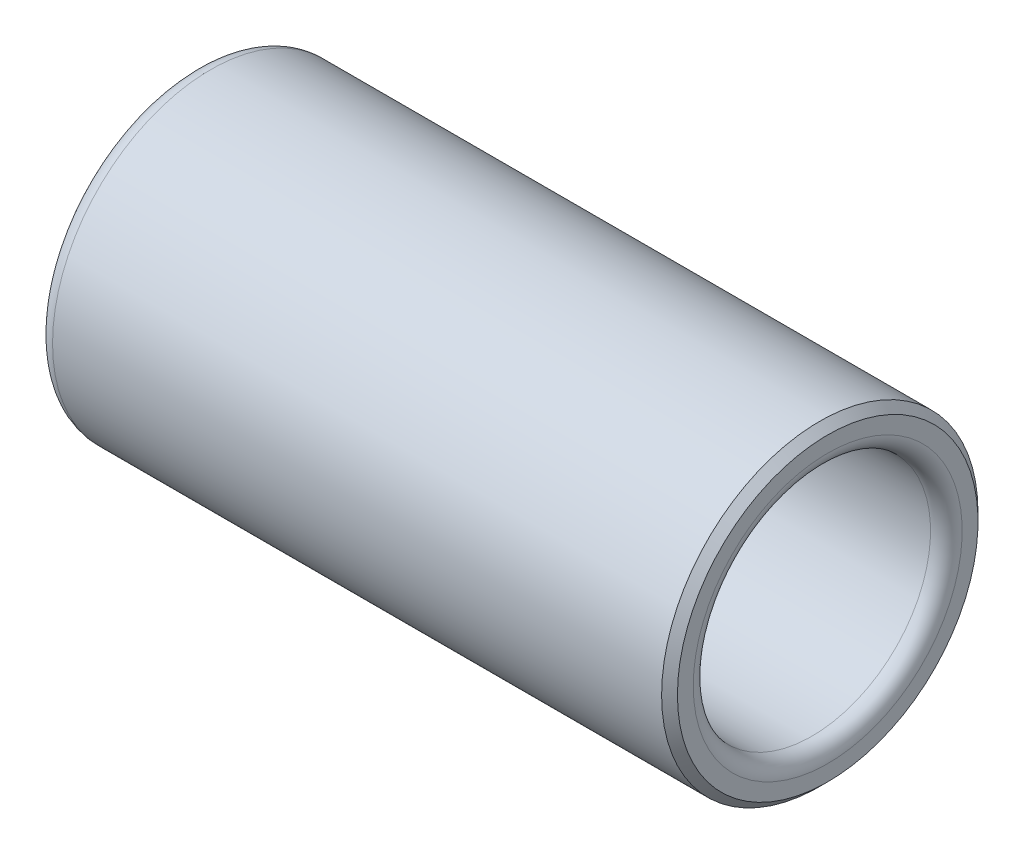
from build123d import *

# Parameters (mm, degrees)
CHANFREIN1_SIZE = 0.5
CONG_1_R        = 1


with BuildPart() as part:
    # Esquisse1 → R_volution1 (revolve)
    with BuildSketch(Plane.XY, mode=Mode.PRIVATE) as r_volution1_sk:
        Polygon((0, 6), (0, 10), (40, 10), (40, 7.5), (7.598076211, 7.5), (5, 6), align=None)
    revolve(r_volution1_sk.sketch.rotate(Axis((-64.639502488, 0, 0), (1, 0, 0)), 90), axis=Axis((-64.639502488, 0, 0), (1, 0, 0)))

    # Chanfrein1
    chanfrein1_edges = [part.edges().sort_by_distance(p)[0] for p in [
        (40, 0, -10),
    ]]
    chamfer(chanfrein1_edges, length=CHANFREIN1_SIZE)

    # Cong_1
    cong_1_edges = [part.edges().sort_by_distance(p)[0] for p in [
        (0, 0, -10),
        (40, 0, -7.5),
    ]]
    fillet(cong_1_edges, radius=CONG_1_R)


solid = part.part
